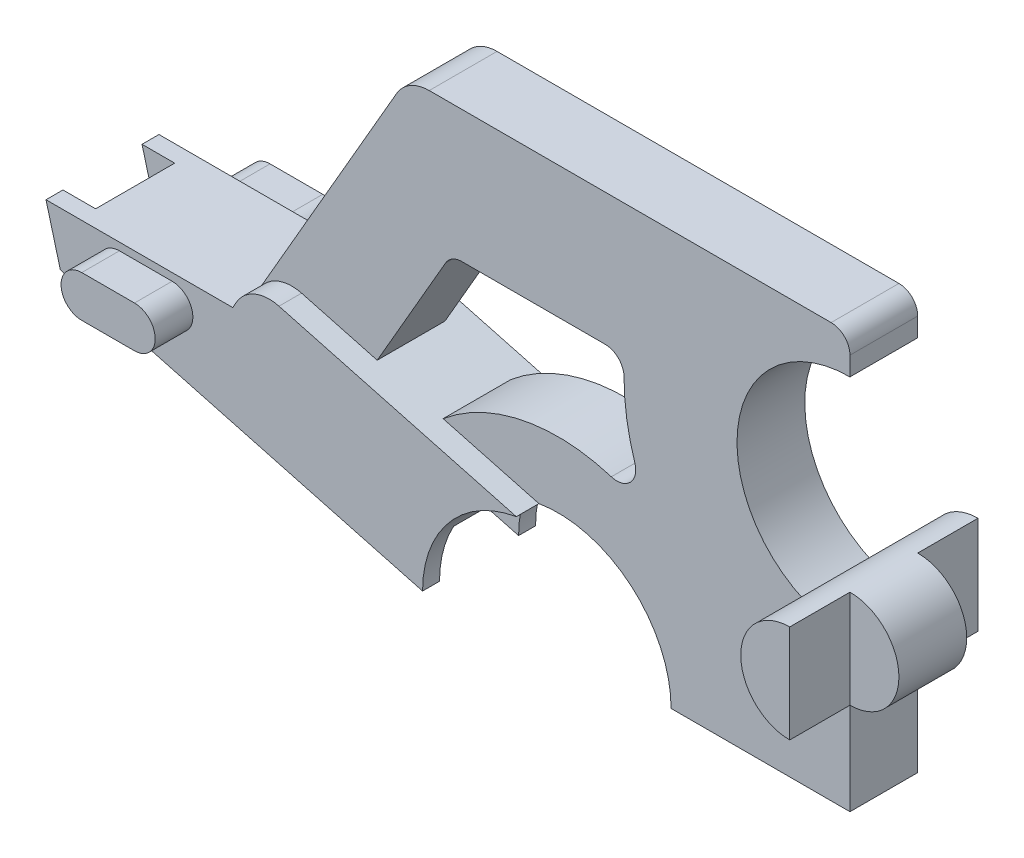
ISO-10303-21;
HEADER;
FILE_DESCRIPTION(('STEP AP214'),'2;1');
FILE_NAME('part.step','',(''),(''),'','','');
FILE_SCHEMA(('AUTOMOTIVE_DESIGN { 1 0 10303 214 1 1 1 1 }'));
ENDSEC;
DATA;
#1=APPLICATION_CONTEXT('core data for automotive mechanical design processes');
#2=APPLICATION_PROTOCOL_DEFINITION('international standard','automotive_design',2000,#1);
#3=PRODUCT_CONTEXT('',#1,'mechanical');
#4=PRODUCT('Part','Part','',(#3));
#5=PRODUCT_RELATED_PRODUCT_CATEGORY('part','',(#4));
#6=PRODUCT_DEFINITION_FORMATION('','',#4);
#7=PRODUCT_DEFINITION_CONTEXT('part definition',#1,'design');
#8=PRODUCT_DEFINITION('design','',#6,#7);
#9=PRODUCT_DEFINITION_SHAPE('','',#8);
#10=(LENGTH_UNIT() NAMED_UNIT(*) SI_UNIT(.MILLI.,.METRE.));
#11=(NAMED_UNIT(*) PLANE_ANGLE_UNIT() SI_UNIT($,.RADIAN.));
#12=(NAMED_UNIT(*) SI_UNIT($,.STERADIAN.) SOLID_ANGLE_UNIT());
#13=UNCERTAINTY_MEASURE_WITH_UNIT(LENGTH_MEASURE(1.E-05),#10,'distance_accuracy_value','');
#14=(GEOMETRIC_REPRESENTATION_CONTEXT(3) GLOBAL_UNCERTAINTY_ASSIGNED_CONTEXT((#13)) GLOBAL_UNIT_ASSIGNED_CONTEXT((#10,
#11,#12)) REPRESENTATION_CONTEXT('',''));
#15=CARTESIAN_POINT('',(0.,0.,0.));
#16=DIRECTION('',(0.,0.,1.));
#17=DIRECTION('',(1.,0.,0.));
#18=AXIS2_PLACEMENT_3D('',#15,#16,#17);
#19=CARTESIAN_POINT('',(-26.,8.,1.8));
#20=DIRECTION('',(0.965925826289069,0.258819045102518,0.));
#21=DIRECTION('',(-0.258819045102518,0.965925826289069,0.));
#22=AXIS2_PLACEMENT_3D('',#19,#20,#21);
#23=PLANE('',#22);
#24=DIRECTION('',(-0.258819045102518,0.965925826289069,0.));
#25=VECTOR('',#24,1.);
#26=CARTESIAN_POINT('',(-26.,8.,2.1));
#27=LINE('',#26,#25);
#28=CARTESIAN_POINT('',(-25.237604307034,5.15470053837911,2.1));
#29=VERTEX_POINT('',#28);
#30=CARTESIAN_POINT('',(-26.,8.,2.1));
#31=VERTEX_POINT('',#30);
#32=EDGE_CURVE('E295',#29,#31,#27,.T.);
#33=ORIENTED_EDGE('',*,*,#32,.F.);
#34=DIRECTION('',(0.,0.,-1.));
#35=VECTOR('',#34,1.);
#36=CARTESIAN_POINT('',(-25.237604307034,5.15470053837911,1.8));
#37=LINE('',#36,#35);
#38=CARTESIAN_POINT('',(-25.237604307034,5.15470053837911,3.));
#39=VERTEX_POINT('',#38);
#40=EDGE_CURVE('E545',#39,#29,#37,.T.);
#41=ORIENTED_EDGE('',*,*,#40,.F.);
#42=DIRECTION('',(0.258819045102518,-0.965925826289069,0.));
#43=VECTOR('',#42,1.);
#44=CARTESIAN_POINT('',(-26.,8.,3.));
#45=LINE('',#44,#43);
#46=CARTESIAN_POINT('',(-26.,8.,3.));
#47=VERTEX_POINT('',#46);
#48=EDGE_CURVE('E438',#47,#39,#45,.T.);
#49=ORIENTED_EDGE('',*,*,#48,.F.);
#50=DIRECTION('',(0.,0.,-1.));
#51=VECTOR('',#50,1.);
#52=CARTESIAN_POINT('',(-26.,8.,1.8));
#53=LINE('',#52,#51);
#54=EDGE_CURVE('E549',#47,#31,#53,.T.);
#55=ORIENTED_EDGE('',*,*,#54,.T.);
#56=EDGE_LOOP('',(#33,#41,#49,#55));
#57=FACE_BOUND('',#56,.T.);
#58=ADVANCED_FACE('F17',(#57),#23,.F.);
#59=CARTESIAN_POINT('',(-6.,0.,1.8));
#60=DIRECTION('',(0.258819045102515,0.96592582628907,0.));
#61=DIRECTION('',(-0.96592582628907,0.258819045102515,0.));
#62=AXIS2_PLACEMENT_3D('',#59,#60,#61);
#63=PLANE('',#62);
#64=DIRECTION('',(-0.96592582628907,0.258819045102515,0.));
#65=VECTOR('',#64,1.);
#66=CARTESIAN_POINT('',(-6.,0.,2.1));
#67=LINE('',#66,#65);
#68=CARTESIAN_POINT('',(-6.,0.,2.1));
#69=VERTEX_POINT('',#68);
#70=EDGE_CURVE('E620',#69,#29,#67,.T.);
#71=ORIENTED_EDGE('',*,*,#70,.F.);
#72=DIRECTION('',(0.,0.,-1.));
#73=VECTOR('',#72,1.);
#74=CARTESIAN_POINT('',(-6.,0.,1.8));
#75=LINE('',#74,#73);
#76=CARTESIAN_POINT('',(-6.,0.,3.));
#77=VERTEX_POINT('',#76);
#78=EDGE_CURVE('E541',#77,#69,#75,.T.);
#79=ORIENTED_EDGE('',*,*,#78,.F.);
#80=DIRECTION('',(0.96592582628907,-0.258819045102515,0.));
#81=VECTOR('',#80,1.);
#82=CARTESIAN_POINT('',(-25.237604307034,5.15470053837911,3.));
#83=LINE('',#82,#81);
#84=EDGE_CURVE('E441',#39,#77,#83,.T.);
#85=ORIENTED_EDGE('',*,*,#84,.F.);
#86=ORIENTED_EDGE('',*,*,#40,.T.);
#87=EDGE_LOOP('',(#71,#79,#85,#86));
#88=FACE_BOUND('',#87,.T.);
#89=ADVANCED_FACE('F622',(#88),#63,.F.);
#90=CARTESIAN_POINT('',(-14.143860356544,7.35852170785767,-3.));
#91=DIRECTION('',(0.,0.,-1.));
#92=DIRECTION('',(-1.,0.,0.));
#93=AXIS2_PLACEMENT_3D('',#90,#91,#92);
#94=PLANE('',#93);
#95=CARTESIAN_POINT('',(-14.143860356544,7.35852170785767,-3.));
#96=DIRECTION('',(0.,0.,1.));
#97=DIRECTION('',(-1.,0.,0.));
#98=AXIS2_PLACEMENT_3D('',#95,#96,#97);
#99=CIRCLE('',#98,2.);
#100=CARTESIAN_POINT('',(-13.626222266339,9.29037336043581,-3.));
#101=VERTEX_POINT('',#100);
#102=CARTESIAN_POINT('',(-15.8759111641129,8.35852170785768,-3.));
#103=VERTEX_POINT('',#102);
#104=EDGE_CURVE('E408',#101,#103,#99,.T.);
#105=ORIENTED_EDGE('',*,*,#104,.F.);
#106=DIRECTION('',(-0.96592582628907,0.258819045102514,0.));
#107=VECTOR('',#106,1.);
#108=CARTESIAN_POINT('',(-13.626222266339,9.29037336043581,-3.));
#109=LINE('',#108,#107);
#110=CARTESIAN_POINT('',(-1.02026809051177,5.91261811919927,-3.));
#111=VERTEX_POINT('',#110);
#112=EDGE_CURVE('E426',#111,#101,#109,.T.);
#113=ORIENTED_EDGE('',*,*,#112,.F.);
#114=CARTESIAN_POINT('',(0.,0.,-3.));
#115=DIRECTION('',(0.,0.,-1.));
#116=DIRECTION('',(1.,0.,0.));
#117=AXIS2_PLACEMENT_3D('',#114,#115,#116);
#118=CIRCLE('',#117,6.);
#119=CARTESIAN_POINT('',(-6.,0.,-3.));
#120=VERTEX_POINT('',#119);
#121=EDGE_CURVE('E423',#120,#111,#118,.T.);
#122=ORIENTED_EDGE('',*,*,#121,.F.);
#123=DIRECTION('',(0.96592582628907,-0.258819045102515,0.));
#124=VECTOR('',#123,1.);
#125=CARTESIAN_POINT('',(-25.237604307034,5.15470053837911,-3.));
#126=LINE('',#125,#124);
#127=CARTESIAN_POINT('',(-25.237604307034,5.15470053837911,-3.));
#128=VERTEX_POINT('',#127);
#129=EDGE_CURVE('E420',#128,#120,#126,.T.);
#130=ORIENTED_EDGE('',*,*,#129,.F.);
#131=DIRECTION('',(0.258819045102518,-0.965925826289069,0.));
#132=VECTOR('',#131,1.);
#133=CARTESIAN_POINT('',(-26.,8.,-3.));
#134=LINE('',#133,#132);
#135=CARTESIAN_POINT('',(-26.,8.,-3.));
#136=VERTEX_POINT('',#135);
#137=EDGE_CURVE('E417',#136,#128,#134,.T.);
#138=ORIENTED_EDGE('',*,*,#137,.F.);
#139=DIRECTION('',(-1.,0.,0.));
#140=VECTOR('',#139,1.);
#141=CARTESIAN_POINT('',(-16.0829037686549,8.,-3.));
#142=LINE('',#141,#140);
#143=CARTESIAN_POINT('',(-16.0829037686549,8.,-3.));
#144=VERTEX_POINT('',#143);
#145=EDGE_CURVE('E414',#144,#136,#142,.T.);
#146=ORIENTED_EDGE('',*,*,#145,.F.);
#147=DIRECTION('',(-0.5,-0.866025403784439,0.));
#148=VECTOR('',#147,1.);
#149=CARTESIAN_POINT('',(-15.8759111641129,8.35852170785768,-3.));
#150=LINE('',#149,#148);
#151=EDGE_CURVE('E411',#103,#144,#150,.T.);
#152=ORIENTED_EDGE('',*,*,#151,.F.);
#153=EDGE_LOOP('',(#105,#113,#122,#130,#138,#146,#152));
#154=FACE_BOUND('',#153,.T.);
#155=DIRECTION('',(-1.,0.,0.));
#156=VECTOR('',#155,1.);
#157=CARTESIAN_POINT('',(-14.143860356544,7.6,-3.));
#158=LINE('',#157,#156);
#159=CARTESIAN_POINT('',(-19.3,7.6,-3.));
#160=VERTEX_POINT('',#159);
#161=CARTESIAN_POINT('',(-22.1,7.6,-3.));
#162=VERTEX_POINT('',#161);
#163=EDGE_CURVE('E356',#160,#162,#158,.T.);
#164=ORIENTED_EDGE('',*,*,#163,.T.);
#165=CARTESIAN_POINT('',(-22.1,6.5,-3.));
#166=DIRECTION('',(0.,0.,-1.));
#167=DIRECTION('',(-1.,0.,0.));
#168=AXIS2_PLACEMENT_3D('',#165,#166,#167);
#169=CIRCLE('',#168,1.1);
#170=CARTESIAN_POINT('',(-22.1,5.4,-3.));
#171=VERTEX_POINT('',#170);
#172=EDGE_CURVE('E365',#162,#171,#169,.F.);
#173=ORIENTED_EDGE('',*,*,#172,.T.);
#174=DIRECTION('',(1.,0.,0.));
#175=VECTOR('',#174,1.);
#176=CARTESIAN_POINT('',(-14.143860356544,5.4,-3.));
#177=LINE('',#176,#175);
#178=CARTESIAN_POINT('',(-19.3,5.4,-3.));
#179=VERTEX_POINT('',#178);
#180=EDGE_CURVE('E362',#171,#179,#177,.T.);
#181=ORIENTED_EDGE('',*,*,#180,.T.);
#182=CARTESIAN_POINT('',(-19.3,6.5,-3.));
#183=DIRECTION('',(0.,0.,-1.));
#184=DIRECTION('',(-1.,0.,0.));
#185=AXIS2_PLACEMENT_3D('',#182,#183,#184);
#186=CIRCLE('',#185,1.1);
#187=EDGE_CURVE('E359',#179,#160,#186,.F.);
#188=ORIENTED_EDGE('',*,*,#187,.T.);
#189=EDGE_LOOP('',(#164,#173,#181,#188));
#190=FACE_BOUND('',#189,.T.);
#191=ADVANCED_FACE('F641',(#154,#190),#94,.T.);
#192=CARTESIAN_POINT('',(-14.143860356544,7.35852170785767,3.));
#193=DIRECTION('',(0.,0.,-1.));
#194=DIRECTION('',(-1.,0.,0.));
#195=AXIS2_PLACEMENT_3D('',#192,#193,#194);
#196=PLANE('',#195);
#197=CARTESIAN_POINT('',(-14.143860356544,7.35852170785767,3.));
#198=DIRECTION('',(0.,0.,1.));
#199=DIRECTION('',(-1.,0.,0.));
#200=AXIS2_PLACEMENT_3D('',#197,#198,#199);
#201=CIRCLE('',#200,2.);
#202=CARTESIAN_POINT('',(-13.626222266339,9.29037336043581,3.));
#203=VERTEX_POINT('',#202);
#204=CARTESIAN_POINT('',(-15.8759111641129,8.35852170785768,3.));
#205=VERTEX_POINT('',#204);
#206=EDGE_CURVE('E429',#203,#205,#201,.T.);
#207=ORIENTED_EDGE('',*,*,#206,.T.);
#208=DIRECTION('',(-0.5,-0.866025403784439,0.));
#209=VECTOR('',#208,1.);
#210=CARTESIAN_POINT('',(-15.8759111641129,8.35852170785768,3.));
#211=LINE('',#210,#209);
#212=CARTESIAN_POINT('',(-16.0829037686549,8.,3.));
#213=VERTEX_POINT('',#212);
#214=EDGE_CURVE('E432',#205,#213,#211,.T.);
#215=ORIENTED_EDGE('',*,*,#214,.T.);
#216=DIRECTION('',(-1.,0.,0.));
#217=VECTOR('',#216,1.);
#218=CARTESIAN_POINT('',(-16.0829037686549,8.,3.));
#219=LINE('',#218,#217);
#220=EDGE_CURVE('E435',#213,#47,#219,.T.);
#221=ORIENTED_EDGE('',*,*,#220,.T.);
#222=ORIENTED_EDGE('',*,*,#48,.T.);
#223=ORIENTED_EDGE('',*,*,#84,.T.);
#224=CARTESIAN_POINT('',(0.,0.,3.));
#225=DIRECTION('',(0.,0.,-1.));
#226=DIRECTION('',(1.,0.,0.));
#227=AXIS2_PLACEMENT_3D('',#224,#225,#226);
#228=CIRCLE('',#227,6.);
#229=CARTESIAN_POINT('',(-1.02026809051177,5.91261811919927,3.));
#230=VERTEX_POINT('',#229);
#231=EDGE_CURVE('E444',#77,#230,#228,.T.);
#232=ORIENTED_EDGE('',*,*,#231,.T.);
#233=DIRECTION('',(-0.96592582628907,0.258819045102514,0.));
#234=VECTOR('',#233,1.);
#235=CARTESIAN_POINT('',(-13.626222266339,9.29037336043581,3.));
#236=LINE('',#235,#234);
#237=EDGE_CURVE('E446',#230,#203,#236,.T.);
#238=ORIENTED_EDGE('',*,*,#237,.T.);
#239=EDGE_LOOP('',(#207,#215,#221,#222,#223,#232,#238));
#240=FACE_BOUND('',#239,.T.);
#241=CARTESIAN_POINT('',(-22.1,6.5,3.));
#242=DIRECTION('',(0.,0.,-1.));
#243=DIRECTION('',(-1.,0.,0.));
#244=AXIS2_PLACEMENT_3D('',#241,#242,#243);
#245=CIRCLE('',#244,1.1);
#246=CARTESIAN_POINT('',(-22.1,7.6,3.));
#247=VERTEX_POINT('',#246);
#248=CARTESIAN_POINT('',(-22.1,5.4,3.));
#249=VERTEX_POINT('',#248);
#250=EDGE_CURVE('E565',#247,#249,#245,.F.);
#251=ORIENTED_EDGE('',*,*,#250,.F.);
#252=DIRECTION('',(-1.,0.,0.));
#253=VECTOR('',#252,1.);
#254=CARTESIAN_POINT('',(-14.143860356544,7.6,3.));
#255=LINE('',#254,#253);
#256=CARTESIAN_POINT('',(-19.3,7.6,3.));
#257=VERTEX_POINT('',#256);
#258=EDGE_CURVE('E556',#257,#247,#255,.T.);
#259=ORIENTED_EDGE('',*,*,#258,.F.);
#260=CARTESIAN_POINT('',(-19.3,6.5,3.));
#261=DIRECTION('',(0.,0.,-1.));
#262=DIRECTION('',(-1.,0.,0.));
#263=AXIS2_PLACEMENT_3D('',#260,#261,#262);
#264=CIRCLE('',#263,1.1);
#265=CARTESIAN_POINT('',(-19.3,5.4,3.));
#266=VERTEX_POINT('',#265);
#267=EDGE_CURVE('E559',#266,#257,#264,.F.);
#268=ORIENTED_EDGE('',*,*,#267,.F.);
#269=DIRECTION('',(1.,0.,0.));
#270=VECTOR('',#269,1.);
#271=CARTESIAN_POINT('',(-14.143860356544,5.4,3.));
#272=LINE('',#271,#270);
#273=EDGE_CURVE('E562',#249,#266,#272,.T.);
#274=ORIENTED_EDGE('',*,*,#273,.F.);
#275=EDGE_LOOP('',(#251,#259,#268,#274));
#276=FACE_BOUND('',#275,.T.);
#277=ADVANCED_FACE('F746',(#240,#276),#196,.F.);
#278=CARTESIAN_POINT('',(0.,0.,1.8));
#279=DIRECTION('',(0.,0.,1.));
#280=DIRECTION('',(1.,0.,0.));
#281=AXIS2_PLACEMENT_3D('',#278,#279,#280);
#282=PLANE('',#281);
#283=DIRECTION('',(0.,1.,0.));
#284=VECTOR('',#283,1.);
#285=CARTESIAN_POINT('',(15.5,20.,1.8));
#286=LINE('',#285,#284);
#287=CARTESIAN_POINT('',(15.5,20.,1.8));
#288=VERTEX_POINT('',#287);
#289=CARTESIAN_POINT('',(15.5,21.,1.8));
#290=VERTEX_POINT('',#289);
#291=EDGE_CURVE('E527',#288,#290,#286,.T.);
#292=ORIENTED_EDGE('',*,*,#291,.T.);
#293=CARTESIAN_POINT('',(14.5,21.,1.8));
#294=DIRECTION('',(0.,0.,1.));
#295=DIRECTION('',(1.,0.,0.));
#296=AXIS2_PLACEMENT_3D('',#293,#294,#295);
#297=CIRCLE('',#296,1.);
#298=CARTESIAN_POINT('',(14.5,22.,1.8));
#299=VERTEX_POINT('',#298);
#300=EDGE_CURVE('E600',#290,#299,#297,.T.);
#301=ORIENTED_EDGE('',*,*,#300,.T.);
#302=DIRECTION('',(-1.,0.,0.));
#303=VECTOR('',#302,1.);
#304=CARTESIAN_POINT('',(-8.,22.,1.8));
#305=LINE('',#304,#303);
#306=CARTESIAN_POINT('',(-6.84529946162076,22.,1.8));
#307=VERTEX_POINT('',#306);
#308=EDGE_CURVE('E529',#299,#307,#305,.T.);
#309=ORIENTED_EDGE('',*,*,#308,.T.);
#310=CARTESIAN_POINT('',(-6.84529946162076,20.,1.8));
#311=DIRECTION('',(0.,0.,1.));
#312=DIRECTION('',(1.,0.,0.));
#313=AXIS2_PLACEMENT_3D('',#310,#311,#312);
#314=CIRCLE('',#313,2.);
#315=CARTESIAN_POINT('',(-8.57735026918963,21.,1.8));
#316=VERTEX_POINT('',#315);
#317=EDGE_CURVE('E577',#307,#316,#314,.T.);
#318=ORIENTED_EDGE('',*,*,#317,.T.);
#319=DIRECTION('',(-0.5,-0.866025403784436,0.));
#320=VECTOR('',#319,1.);
#321=CARTESIAN_POINT('',(-8.,22.,1.8));
#322=LINE('',#321,#320);
#323=CARTESIAN_POINT('',(-15.8759111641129,8.35852170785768,1.8));
#324=VERTEX_POINT('',#323);
#325=EDGE_CURVE('E516',#316,#324,#322,.T.);
#326=ORIENTED_EDGE('',*,*,#325,.T.);
#327=CARTESIAN_POINT('',(-14.143860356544,7.35852170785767,1.8));
#328=DIRECTION('',(0.,0.,1.));
#329=DIRECTION('',(1.,0.,0.));
#330=AXIS2_PLACEMENT_3D('',#327,#328,#329);
#331=CIRCLE('',#330,2.);
#332=CARTESIAN_POINT('',(-13.626222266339,9.29037336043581,1.8));
#333=VERTEX_POINT('',#332);
#334=EDGE_CURVE('E470',#324,#333,#331,.F.);
#335=ORIENTED_EDGE('',*,*,#334,.T.);
#336=DIRECTION('',(0.96592582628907,-0.258819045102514,0.));
#337=VECTOR('',#336,1.);
#338=CARTESIAN_POINT('',(1.40980952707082,5.26148078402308,1.8));
#339=LINE('',#338,#337);
#340=CARTESIAN_POINT('',(-9.6085841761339,8.21385047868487,1.8));
#341=VERTEX_POINT('',#340);
#342=EDGE_CURVE('E466',#333,#341,#339,.T.);
#343=ORIENTED_EDGE('',*,*,#342,.T.);
#344=DIRECTION('',(-0.5,-0.866025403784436,0.));
#345=VECTOR('',#344,1.);
#346=CARTESIAN_POINT('',(-9.6085841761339,8.21385047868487,1.8));
#347=LINE('',#346,#345);
#348=CARTESIAN_POINT('',(-5.97927405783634,14.5,1.8));
#349=VERTEX_POINT('',#348);
#350=EDGE_CURVE('E490',#349,#341,#347,.T.);
#351=ORIENTED_EDGE('',*,*,#350,.F.);
#352=CARTESIAN_POINT('',(-5.1132486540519,14.,1.8));
#353=DIRECTION('',(0.,0.,1.));
#354=DIRECTION('',(1.,0.,0.));
#355=AXIS2_PLACEMENT_3D('',#352,#353,#354);
#356=CIRCLE('',#355,1.);
#357=CARTESIAN_POINT('',(-5.1132486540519,15.,1.8));
#358=VERTEX_POINT('',#357);
#359=EDGE_CURVE('E604',#349,#358,#356,.F.);
#360=ORIENTED_EDGE('',*,*,#359,.T.);
#361=DIRECTION('',(-1.,0.,0.));
#362=VECTOR('',#361,1.);
#363=CARTESIAN_POINT('',(-5.69059892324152,15.,1.8));
#364=LINE('',#363,#362);
#365=CARTESIAN_POINT('',(2.5,15.,1.8));
#366=VERTEX_POINT('',#365);
#367=EDGE_CURVE('E487',#366,#358,#364,.T.);
#368=ORIENTED_EDGE('',*,*,#367,.F.);
#369=CARTESIAN_POINT('',(2.5,14.,1.8));
#370=DIRECTION('',(0.,0.,1.));
#371=DIRECTION('',(1.,0.,0.));
#372=AXIS2_PLACEMENT_3D('',#369,#370,#371);
#373=CIRCLE('',#372,1.);
#374=CARTESIAN_POINT('',(3.5,14.,1.8));
#375=VERTEX_POINT('',#374);
#376=EDGE_CURVE('E608',#366,#375,#373,.F.);
#377=ORIENTED_EDGE('',*,*,#376,.T.);
#378=CARTESIAN_POINT('',(15.5,14.,1.8));
#379=DIRECTION('',(0.,0.,-1.));
#380=DIRECTION('',(1.,0.,0.));
#381=AXIS2_PLACEMENT_3D('',#378,#379,#380);
#382=CIRCLE('',#381,12.);
#383=CARTESIAN_POINT('',(4.07475549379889,10.3306965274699,1.8));
#384=VERTEX_POINT('',#383);
#385=EDGE_CURVE('E484',#384,#375,#382,.T.);
#386=ORIENTED_EDGE('',*,*,#385,.F.);
#387=CARTESIAN_POINT('',(3.1226517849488,10.0249212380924,1.8));
#388=DIRECTION('',(0.,0.,1.));
#389=DIRECTION('',(1.,0.,0.));
#390=AXIS2_PLACEMENT_3D('',#387,#388,#389);
#391=CIRCLE('',#390,1.);
#392=CARTESIAN_POINT('',(2.82525637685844,9.07016683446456,1.8));
#393=VERTEX_POINT('',#392);
#394=EDGE_CURVE('E612',#384,#393,#391,.F.);
#395=ORIENTED_EDGE('',*,*,#394,.T.);
#396=CARTESIAN_POINT('',(0.,0.,1.8));
#397=DIRECTION('',(0.,0.,-1.));
#398=DIRECTION('',(1.,0.,0.));
#399=AXIS2_PLACEMENT_3D('',#396,#397,#398);
#400=CIRCLE('',#399,9.5);
#401=CARTESIAN_POINT('',(-6.10824981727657,7.27593871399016,1.8));
#402=VERTEX_POINT('',#401);
#403=EDGE_CURVE('E492',#402,#393,#400,.T.);
#404=ORIENTED_EDGE('',*,*,#403,.F.);
#405=CARTESIAN_POINT('',(-1.02026809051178,5.91261811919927,1.8));
#406=VERTEX_POINT('',#405);
#407=EDGE_CURVE('E462',#402,#406,#339,.T.);
#408=ORIENTED_EDGE('',*,*,#407,.T.);
#409=CARTESIAN_POINT('',(0.,0.,1.8));
#410=DIRECTION('',(0.,0.,-1.));
#411=DIRECTION('',(1.,0.,0.));
#412=AXIS2_PLACEMENT_3D('',#409,#410,#411);
#413=CIRCLE('',#412,6.);
#414=CARTESIAN_POINT('',(6.,0.,1.8));
#415=VERTEX_POINT('',#414);
#416=EDGE_CURVE('E518',#406,#415,#413,.T.);
#417=ORIENTED_EDGE('',*,*,#416,.T.);
#418=DIRECTION('',(1.,0.,0.));
#419=VECTOR('',#418,1.);
#420=CARTESIAN_POINT('',(6.,0.,1.8));
#421=LINE('',#420,#419);
#422=CARTESIAN_POINT('',(15.5,0.,1.8));
#423=VERTEX_POINT('',#422);
#424=EDGE_CURVE('E520',#415,#423,#421,.T.);
#425=ORIENTED_EDGE('',*,*,#424,.T.);
#426=DIRECTION('',(0.,1.,0.));
#427=VECTOR('',#426,1.);
#428=CARTESIAN_POINT('',(15.5,0.,1.8));
#429=LINE('',#428,#427);
#430=CARTESIAN_POINT('',(15.5,4.9,1.8));
#431=VERTEX_POINT('',#430);
#432=EDGE_CURVE('E522',#423,#431,#429,.T.);
#433=ORIENTED_EDGE('',*,*,#432,.T.);
#434=CARTESIAN_POINT('',(15.5,7.5,1.8));
#435=DIRECTION('',(0.,0.,1.));
#436=DIRECTION('',(1.,0.,0.));
#437=AXIS2_PLACEMENT_3D('',#434,#435,#436);
#438=CIRCLE('',#437,2.6);
#439=CARTESIAN_POINT('',(13.1003206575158,8.50076923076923,1.8));
#440=VERTEX_POINT('',#439);
#441=EDGE_CURVE('E402',#431,#440,#438,.F.);
#442=ORIENTED_EDGE('',*,*,#441,.T.);
#443=CARTESIAN_POINT('',(15.5,14.,1.8));
#444=DIRECTION('',(0.,0.,-1.));
#445=DIRECTION('',(-1.,0.,0.));
#446=AXIS2_PLACEMENT_3D('',#443,#444,#445);
#447=CIRCLE('',#446,6.);
#448=EDGE_CURVE('E525',#440,#288,#447,.T.);
#449=ORIENTED_EDGE('',*,*,#448,.T.);
#450=EDGE_LOOP('',(#292,#301,#309,#318,#326,#335,#343,#351,#360,#368,#377,#386,#395,#404,#408,
#417,#425,#433,#442,#449));
#451=FACE_BOUND('',#450,.T.);
#452=ADVANCED_FACE('F749',(#451),#282,.T.);
#453=CARTESIAN_POINT('',(0.,0.,-1.8));
#454=DIRECTION('',(0.,0.,1.));
#455=DIRECTION('',(1.,0.,0.));
#456=AXIS2_PLACEMENT_3D('',#453,#454,#455);
#457=PLANE('',#456);
#458=DIRECTION('',(-1.,0.,0.));
#459=VECTOR('',#458,1.);
#460=CARTESIAN_POINT('',(-8.,22.,-1.8));
#461=LINE('',#460,#459);
#462=CARTESIAN_POINT('',(14.5,22.,-1.8));
#463=VERTEX_POINT('',#462);
#464=CARTESIAN_POINT('',(-6.84529946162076,22.,-1.8));
#465=VERTEX_POINT('',#464);
#466=EDGE_CURVE('E514',#463,#465,#461,.T.);
#467=ORIENTED_EDGE('',*,*,#466,.F.);
#468=CARTESIAN_POINT('',(14.5,21.,-1.8));
#469=DIRECTION('',(0.,0.,1.));
#470=DIRECTION('',(1.,0.,0.));
#471=AXIS2_PLACEMENT_3D('',#468,#469,#470);
#472=CIRCLE('',#471,1.);
#473=CARTESIAN_POINT('',(15.5,21.,-1.8));
#474=VERTEX_POINT('',#473);
#475=EDGE_CURVE('E597',#463,#474,#472,.F.);
#476=ORIENTED_EDGE('',*,*,#475,.T.);
#477=DIRECTION('',(0.,1.,0.));
#478=VECTOR('',#477,1.);
#479=CARTESIAN_POINT('',(15.5,20.,-1.8));
#480=LINE('',#479,#478);
#481=CARTESIAN_POINT('',(15.5,20.,-1.8));
#482=VERTEX_POINT('',#481);
#483=EDGE_CURVE('E512',#482,#474,#480,.T.);
#484=ORIENTED_EDGE('',*,*,#483,.F.);
#485=CARTESIAN_POINT('',(15.5,14.,-1.8));
#486=DIRECTION('',(0.,0.,-1.));
#487=DIRECTION('',(-1.,0.,0.));
#488=AXIS2_PLACEMENT_3D('',#485,#486,#487);
#489=CIRCLE('',#488,6.);
#490=CARTESIAN_POINT('',(13.1003206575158,8.50076923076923,-1.8));
#491=VERTEX_POINT('',#490);
#492=EDGE_CURVE('E510',#491,#482,#489,.T.);
#493=ORIENTED_EDGE('',*,*,#492,.F.);
#494=CARTESIAN_POINT('',(15.5,7.5,-1.8));
#495=DIRECTION('',(0.,0.,1.));
#496=DIRECTION('',(1.,0.,0.));
#497=AXIS2_PLACEMENT_3D('',#494,#495,#496);
#498=CIRCLE('',#497,2.6);
#499=CARTESIAN_POINT('',(15.5,4.9,-1.8));
#500=VERTEX_POINT('',#499);
#501=EDGE_CURVE('E399',#500,#491,#498,.F.);
#502=ORIENTED_EDGE('',*,*,#501,.F.);
#503=DIRECTION('',(0.,1.,0.));
#504=VECTOR('',#503,1.);
#505=CARTESIAN_POINT('',(15.5,0.,-1.8));
#506=LINE('',#505,#504);
#507=CARTESIAN_POINT('',(15.5,0.,-1.8));
#508=VERTEX_POINT('',#507);
#509=EDGE_CURVE('E507',#508,#500,#506,.T.);
#510=ORIENTED_EDGE('',*,*,#509,.F.);
#511=DIRECTION('',(1.,0.,0.));
#512=VECTOR('',#511,1.);
#513=CARTESIAN_POINT('',(6.,0.,-1.8));
#514=LINE('',#513,#512);
#515=CARTESIAN_POINT('',(6.,0.,-1.8));
#516=VERTEX_POINT('',#515);
#517=EDGE_CURVE('E505',#516,#508,#514,.T.);
#518=ORIENTED_EDGE('',*,*,#517,.F.);
#519=CARTESIAN_POINT('',(0.,0.,-1.8));
#520=DIRECTION('',(0.,0.,-1.));
#521=DIRECTION('',(1.,0.,0.));
#522=AXIS2_PLACEMENT_3D('',#519,#520,#521);
#523=CIRCLE('',#522,6.);
#524=CARTESIAN_POINT('',(-1.02026809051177,5.91261811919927,-1.8));
#525=VERTEX_POINT('',#524);
#526=EDGE_CURVE('E503',#525,#516,#523,.T.);
#527=ORIENTED_EDGE('',*,*,#526,.F.);
#528=DIRECTION('',(0.96592582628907,-0.258819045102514,0.));
#529=VECTOR('',#528,1.);
#530=CARTESIAN_POINT('',(1.40980952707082,5.26148078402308,-1.8));
#531=LINE('',#530,#529);
#532=CARTESIAN_POINT('',(-6.10824981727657,7.27593871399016,-1.8));
#533=VERTEX_POINT('',#532);
#534=EDGE_CURVE('E459',#533,#525,#531,.T.);
#535=ORIENTED_EDGE('',*,*,#534,.F.);
#536=CARTESIAN_POINT('',(0.,0.,-1.8));
#537=DIRECTION('',(0.,0.,-1.));
#538=DIRECTION('',(1.,0.,0.));
#539=AXIS2_PLACEMENT_3D('',#536,#537,#538);
#540=CIRCLE('',#539,9.5);
#541=CARTESIAN_POINT('',(2.82525637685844,9.07016683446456,-1.8));
#542=VERTEX_POINT('',#541);
#543=EDGE_CURVE('E481',#533,#542,#540,.T.);
#544=ORIENTED_EDGE('',*,*,#543,.T.);
#545=CARTESIAN_POINT('',(3.1226517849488,10.0249212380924,-1.8));
#546=DIRECTION('',(0.,0.,1.));
#547=DIRECTION('',(1.,0.,0.));
#548=AXIS2_PLACEMENT_3D('',#545,#546,#547);
#549=CIRCLE('',#548,1.);
#550=CARTESIAN_POINT('',(4.07475549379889,10.3306965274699,-1.8));
#551=VERTEX_POINT('',#550);
#552=EDGE_CURVE('E610',#542,#551,#549,.T.);
#553=ORIENTED_EDGE('',*,*,#552,.T.);
#554=CARTESIAN_POINT('',(15.5,14.,-1.8));
#555=DIRECTION('',(0.,0.,-1.));
#556=DIRECTION('',(1.,0.,0.));
#557=AXIS2_PLACEMENT_3D('',#554,#555,#556);
#558=CIRCLE('',#557,12.);
#559=CARTESIAN_POINT('',(3.5,14.,-1.8));
#560=VERTEX_POINT('',#559);
#561=EDGE_CURVE('E473',#551,#560,#558,.T.);
#562=ORIENTED_EDGE('',*,*,#561,.T.);
#563=CARTESIAN_POINT('',(2.5,14.,-1.8));
#564=DIRECTION('',(0.,0.,1.));
#565=DIRECTION('',(1.,0.,0.));
#566=AXIS2_PLACEMENT_3D('',#563,#564,#565);
#567=CIRCLE('',#566,1.);
#568=CARTESIAN_POINT('',(2.5,15.,-1.8));
#569=VERTEX_POINT('',#568);
#570=EDGE_CURVE('E606',#560,#569,#567,.T.);
#571=ORIENTED_EDGE('',*,*,#570,.T.);
#572=DIRECTION('',(-1.,0.,0.));
#573=VECTOR('',#572,1.);
#574=CARTESIAN_POINT('',(-5.69059892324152,15.,-1.8));
#575=LINE('',#574,#573);
#576=CARTESIAN_POINT('',(-5.1132486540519,15.,-1.8));
#577=VERTEX_POINT('',#576);
#578=EDGE_CURVE('E476',#569,#577,#575,.T.);
#579=ORIENTED_EDGE('',*,*,#578,.T.);
#580=CARTESIAN_POINT('',(-5.1132486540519,14.,-1.8));
#581=DIRECTION('',(0.,0.,1.));
#582=DIRECTION('',(1.,0.,0.));
#583=AXIS2_PLACEMENT_3D('',#580,#581,#582);
#584=CIRCLE('',#583,1.);
#585=CARTESIAN_POINT('',(-5.97927405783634,14.5,-1.8));
#586=VERTEX_POINT('',#585);
#587=EDGE_CURVE('E602',#577,#586,#584,.T.);
#588=ORIENTED_EDGE('',*,*,#587,.T.);
#589=DIRECTION('',(-0.5,-0.866025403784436,0.));
#590=VECTOR('',#589,1.);
#591=CARTESIAN_POINT('',(-9.6085841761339,8.21385047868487,-1.8));
#592=LINE('',#591,#590);
#593=CARTESIAN_POINT('',(-9.6085841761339,8.21385047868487,-1.8));
#594=VERTEX_POINT('',#593);
#595=EDGE_CURVE('E479',#586,#594,#592,.T.);
#596=ORIENTED_EDGE('',*,*,#595,.T.);
#597=CARTESIAN_POINT('',(-13.626222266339,9.29037336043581,-1.8));
#598=VERTEX_POINT('',#597);
#599=EDGE_CURVE('E463',#598,#594,#531,.T.);
#600=ORIENTED_EDGE('',*,*,#599,.F.);
#601=CARTESIAN_POINT('',(-14.143860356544,7.35852170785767,-1.8));
#602=DIRECTION('',(0.,0.,1.));
#603=DIRECTION('',(1.,0.,0.));
#604=AXIS2_PLACEMENT_3D('',#601,#602,#603);
#605=CIRCLE('',#604,2.);
#606=CARTESIAN_POINT('',(-15.8759111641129,8.35852170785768,-1.8));
#607=VERTEX_POINT('',#606);
#608=EDGE_CURVE('E467',#607,#598,#605,.F.);
#609=ORIENTED_EDGE('',*,*,#608,.F.);
#610=DIRECTION('',(-0.5,-0.866025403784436,0.));
#611=VECTOR('',#610,1.);
#612=CARTESIAN_POINT('',(-8.,22.,-1.8));
#613=LINE('',#612,#611);
#614=CARTESIAN_POINT('',(-8.57735026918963,21.,-1.8));
#615=VERTEX_POINT('',#614);
#616=EDGE_CURVE('E501',#615,#607,#613,.T.);
#617=ORIENTED_EDGE('',*,*,#616,.F.);
#618=CARTESIAN_POINT('',(-6.84529946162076,20.,-1.8));
#619=DIRECTION('',(0.,0.,1.));
#620=DIRECTION('',(1.,0.,0.));
#621=AXIS2_PLACEMENT_3D('',#618,#619,#620);
#622=CIRCLE('',#621,2.);
#623=EDGE_CURVE('E571',#615,#465,#622,.F.);
#624=ORIENTED_EDGE('',*,*,#623,.T.);
#625=EDGE_LOOP('',(#467,#476,#484,#493,#502,#510,#518,#527,#535,#544,#553,#562,#571,#579,#588,
#596,#600,#609,#617,#624));
#626=FACE_BOUND('',#625,.T.);
#627=ADVANCED_FACE('F693',(#626),#457,.F.);
#628=CARTESIAN_POINT('',(15.5,0.,1.8));
#629=DIRECTION('',(-1.,0.,0.));
#630=DIRECTION('',(0.,0.,1.));
#631=AXIS2_PLACEMENT_3D('',#628,#629,#630);
#632=PLANE('',#631);
#633=DIRECTION('',(0.,0.,-1.));
#634=VECTOR('',#633,1.);
#635=CARTESIAN_POINT('',(15.5,4.9,5.));
#636=LINE('',#635,#634);
#637=EDGE_CURVE('E405',#431,#500,#636,.T.);
#638=ORIENTED_EDGE('',*,*,#637,.F.);
#639=ORIENTED_EDGE('',*,*,#432,.F.);
#640=DIRECTION('',(0.,0.,-1.));
#641=VECTOR('',#640,1.);
#642=CARTESIAN_POINT('',(15.5,0.,1.8));
#643=LINE('',#642,#641);
#644=EDGE_CURVE('E534',#423,#508,#643,.T.);
#645=ORIENTED_EDGE('',*,*,#644,.T.);
#646=ORIENTED_EDGE('',*,*,#509,.T.);
#647=EDGE_LOOP('',(#638,#639,#645,#646));
#648=FACE_BOUND('',#647,.T.);
#649=ADVANCED_FACE('F678',(#648),#632,.F.);
#650=CARTESIAN_POINT('',(15.5,14.,1.8));
#651=DIRECTION('',(0.,0.,-1.));
#652=DIRECTION('',(-1.,0.,0.));
#653=AXIS2_PLACEMENT_3D('',#650,#651,#652);
#654=CYLINDRICAL_SURFACE('',#653,6.);
#655=DIRECTION('',(0.,0.,-1.));
#656=VECTOR('',#655,1.);
#657=CARTESIAN_POINT('',(13.1003206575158,8.50076923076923,0.));
#658=LINE('',#657,#656);
#659=EDGE_CURVE('E553',#491,#440,#658,.F.);
#660=ORIENTED_EDGE('',*,*,#659,.F.);
#661=ORIENTED_EDGE('',*,*,#492,.T.);
#662=DIRECTION('',(0.,0.,-1.));
#663=VECTOR('',#662,1.);
#664=CARTESIAN_POINT('',(15.5,20.,1.8));
#665=LINE('',#664,#663);
#666=EDGE_CURVE('E531',#288,#482,#665,.T.);
#667=ORIENTED_EDGE('',*,*,#666,.F.);
#668=ORIENTED_EDGE('',*,*,#448,.F.);
#669=EDGE_LOOP('',(#660,#661,#667,#668));
#670=FACE_BOUND('',#669,.T.);
#671=ADVANCED_FACE('F673',(#670),#654,.F.);
#672=CARTESIAN_POINT('',(-8.,22.,1.8));
#673=DIRECTION('',(0.866025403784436,-0.5,0.));
#674=DIRECTION('',(0.5,0.866025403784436,0.));
#675=AXIS2_PLACEMENT_3D('',#672,#673,#674);
#676=PLANE('',#675);
#677=ORIENTED_EDGE('',*,*,#325,.F.);
#678=DIRECTION('',(0.,0.,-1.));
#679=VECTOR('',#678,1.);
#680=CARTESIAN_POINT('',(-8.57735026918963,21.,1.8));
#681=LINE('',#680,#679);
#682=EDGE_CURVE('E568',#316,#615,#681,.T.);
#683=ORIENTED_EDGE('',*,*,#682,.T.);
#684=ORIENTED_EDGE('',*,*,#616,.T.);
#685=DIRECTION('',(0.,0.,-1.));
#686=VECTOR('',#685,1.);
#687=CARTESIAN_POINT('',(-15.8759111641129,8.35852170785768,3.));
#688=LINE('',#687,#686);
#689=EDGE_CURVE('E455',#607,#103,#688,.T.);
#690=ORIENTED_EDGE('',*,*,#689,.T.);
#691=ORIENTED_EDGE('',*,*,#151,.T.);
#692=DIRECTION('',(0.,0.,-1.));
#693=VECTOR('',#692,1.);
#694=CARTESIAN_POINT('',(-16.0829037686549,8.,1.8));
#695=LINE('',#694,#693);
#696=EDGE_CURVE('E551',#213,#144,#695,.T.);
#697=ORIENTED_EDGE('',*,*,#696,.F.);
#698=ORIENTED_EDGE('',*,*,#214,.F.);
#699=EDGE_CURVE('E456',#205,#324,#688,.T.);
#700=ORIENTED_EDGE('',*,*,#699,.T.);
#701=EDGE_LOOP('',(#677,#683,#684,#690,#691,#697,#698,#700));
#702=FACE_BOUND('',#701,.T.);
#703=ADVANCED_FACE('F19',(#702),#676,.F.);
#704=CARTESIAN_POINT('',(-26.,8.,1.8));
#705=DIRECTION('',(0.,-1.,0.));
#706=DIRECTION('',(1.,0.,0.));
#707=AXIS2_PLACEMENT_3D('',#704,#705,#706);
#708=PLANE('',#707);
#709=CARTESIAN_POINT('',(-26.,8.,-2.1));
#710=VERTEX_POINT('',#709);
#711=EDGE_CURVE('E548',#710,#136,#53,.T.);
#712=ORIENTED_EDGE('',*,*,#711,.F.);
#713=DIRECTION('',(1.,0.,0.));
#714=VECTOR('',#713,1.);
#715=CARTESIAN_POINT('',(-26.,8.,-2.1));
#716=LINE('',#715,#714);
#717=CARTESIAN_POINT('',(-24.2652965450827,8.,-2.1));
#718=VERTEX_POINT('',#717);
#719=EDGE_CURVE('E313',#710,#718,#716,.T.);
#720=ORIENTED_EDGE('',*,*,#719,.T.);
#721=DIRECTION('',(0.,0.,1.));
#722=VECTOR('',#721,1.);
#723=CARTESIAN_POINT('',(-24.2652965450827,8.,1.8));
#724=LINE('',#723,#722);
#725=CARTESIAN_POINT('',(-24.2652965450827,8.,2.1));
#726=VERTEX_POINT('',#725);
#727=EDGE_CURVE('E304',#718,#726,#724,.T.);
#728=ORIENTED_EDGE('',*,*,#727,.T.);
#729=DIRECTION('',(1.,0.,0.));
#730=VECTOR('',#729,1.);
#731=CARTESIAN_POINT('',(-26.,8.,2.1));
#732=LINE('',#731,#730);
#733=EDGE_CURVE('E292',#31,#726,#732,.T.);
#734=ORIENTED_EDGE('',*,*,#733,.F.);
#735=ORIENTED_EDGE('',*,*,#54,.F.);
#736=ORIENTED_EDGE('',*,*,#220,.F.);
#737=ORIENTED_EDGE('',*,*,#696,.T.);
#738=ORIENTED_EDGE('',*,*,#145,.T.);
#739=EDGE_LOOP('',(#712,#720,#728,#734,#735,#736,#737,#738));
#740=FACE_BOUND('',#739,.T.);
#741=ADVANCED_FACE('F312',(#740),#708,.F.);
#742=CARTESIAN_POINT('',(-25.237604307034,5.15470053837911,-2.1));
#743=VERTEX_POINT('',#742);
#744=EDGE_CURVE('E544',#743,#128,#37,.T.);
#745=ORIENTED_EDGE('',*,*,#744,.F.);
#746=DIRECTION('',(-0.258819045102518,0.965925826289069,0.));
#747=VECTOR('',#746,1.);
#748=CARTESIAN_POINT('',(-26.,8.,-2.1));
#749=LINE('',#748,#747);
#750=EDGE_CURVE('E319',#743,#710,#749,.T.);
#751=ORIENTED_EDGE('',*,*,#750,.T.);
#752=ORIENTED_EDGE('',*,*,#711,.T.);
#753=ORIENTED_EDGE('',*,*,#137,.T.);
#754=EDGE_LOOP('',(#745,#751,#752,#753));
#755=FACE_BOUND('',#754,.T.);
#756=ADVANCED_FACE('F632',(#755),#23,.F.);
#757=CARTESIAN_POINT('',(-6.,0.,-2.1));
#758=VERTEX_POINT('',#757);
#759=EDGE_CURVE('E540',#758,#120,#75,.T.);
#760=ORIENTED_EDGE('',*,*,#759,.F.);
#761=DIRECTION('',(-0.96592582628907,0.258819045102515,0.));
#762=VECTOR('',#761,1.);
#763=CARTESIAN_POINT('',(-6.,0.,-2.1));
#764=LINE('',#763,#762);
#765=EDGE_CURVE('E299',#758,#743,#764,.T.);
#766=ORIENTED_EDGE('',*,*,#765,.T.);
#767=ORIENTED_EDGE('',*,*,#744,.T.);
#768=ORIENTED_EDGE('',*,*,#129,.T.);
#769=EDGE_LOOP('',(#760,#766,#767,#768));
#770=FACE_BOUND('',#769,.T.);
#771=ADVANCED_FACE('F646',(#770),#63,.F.);
#772=CARTESIAN_POINT('',(0.,0.,1.8));
#773=DIRECTION('',(0.,0.,-1.));
#774=DIRECTION('',(-1.,0.,0.));
#775=AXIS2_PLACEMENT_3D('',#772,#773,#774);
#776=CYLINDRICAL_SURFACE('',#775,6.);
#777=DIRECTION('',(0.,0.,-1.));
#778=VECTOR('',#777,1.);
#779=CARTESIAN_POINT('',(-5.2499377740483,2.9048499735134,1.8));
#780=LINE('',#779,#778);
#781=CARTESIAN_POINT('',(-5.2499377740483,2.9048499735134,2.1));
#782=VERTEX_POINT('',#781);
#783=CARTESIAN_POINT('',(-5.2499377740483,2.9048499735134,-2.1));
#784=VERTEX_POINT('',#783);
#785=EDGE_CURVE('E25',#782,#784,#780,.T.);
#786=ORIENTED_EDGE('',*,*,#785,.T.);
#787=CARTESIAN_POINT('',(0.,0.,-2.1));
#788=DIRECTION('',(0.,0.,-1.));
#789=DIRECTION('',(-1.,0.,0.));
#790=AXIS2_PLACEMENT_3D('',#787,#788,#789);
#791=CIRCLE('',#790,6.);
#792=EDGE_CURVE('E11',#784,#758,#791,.F.);
#793=ORIENTED_EDGE('',*,*,#792,.T.);
#794=ORIENTED_EDGE('',*,*,#759,.T.);
#795=ORIENTED_EDGE('',*,*,#121,.T.);
#796=DIRECTION('',(0.,0.,-1.));
#797=VECTOR('',#796,1.);
#798=CARTESIAN_POINT('',(-1.02026809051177,5.91261811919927,3.));
#799=LINE('',#798,#797);
#800=EDGE_CURVE('E452',#525,#111,#799,.T.);
#801=ORIENTED_EDGE('',*,*,#800,.F.);
#802=ORIENTED_EDGE('',*,*,#526,.T.);
#803=DIRECTION('',(0.,0.,-1.));
#804=VECTOR('',#803,1.);
#805=CARTESIAN_POINT('',(6.,0.,1.8));
#806=LINE('',#805,#804);
#807=EDGE_CURVE('E537',#415,#516,#806,.T.);
#808=ORIENTED_EDGE('',*,*,#807,.F.);
#809=ORIENTED_EDGE('',*,*,#416,.F.);
#810=EDGE_CURVE('E453',#230,#406,#799,.T.);
#811=ORIENTED_EDGE('',*,*,#810,.F.);
#812=ORIENTED_EDGE('',*,*,#231,.F.);
#813=ORIENTED_EDGE('',*,*,#78,.T.);
#814=CARTESIAN_POINT('',(0.,0.,2.1));
#815=DIRECTION('',(0.,0.,-1.));
#816=DIRECTION('',(-1.,0.,0.));
#817=AXIS2_PLACEMENT_3D('',#814,#815,#816);
#818=CIRCLE('',#817,6.);
#819=EDGE_CURVE('E614',#782,#69,#818,.F.);
#820=ORIENTED_EDGE('',*,*,#819,.F.);
#821=EDGE_LOOP('',(#786,#793,#794,#795,#801,#802,#808,#809,#811,#812,#813,#820));
#822=FACE_BOUND('',#821,.T.);
#823=ADVANCED_FACE('F616',(#822),#776,.F.);
#824=CARTESIAN_POINT('',(6.,0.,1.8));
#825=DIRECTION('',(0.,1.,0.));
#826=DIRECTION('',(0.,0.,1.));
#827=AXIS2_PLACEMENT_3D('',#824,#825,#826);
#828=PLANE('',#827);
#829=ORIENTED_EDGE('',*,*,#517,.T.);
#830=ORIENTED_EDGE('',*,*,#644,.F.);
#831=ORIENTED_EDGE('',*,*,#424,.F.);
#832=ORIENTED_EDGE('',*,*,#807,.T.);
#833=EDGE_LOOP('',(#829,#830,#831,#832));
#834=FACE_BOUND('',#833,.T.);
#835=ADVANCED_FACE('F708',(#834),#828,.F.);
#836=CARTESIAN_POINT('',(15.5,20.,1.8));
#837=DIRECTION('',(-1.,0.,0.));
#838=DIRECTION('',(0.,0.,1.));
#839=AXIS2_PLACEMENT_3D('',#836,#837,#838);
#840=PLANE('',#839);
#841=ORIENTED_EDGE('',*,*,#483,.T.);
#842=DIRECTION('',(0.,0.,-1.));
#843=VECTOR('',#842,1.);
#844=CARTESIAN_POINT('',(15.5,21.,1.8));
#845=LINE('',#844,#843);
#846=EDGE_CURVE('E40',#474,#290,#845,.F.);
#847=ORIENTED_EDGE('',*,*,#846,.T.);
#848=ORIENTED_EDGE('',*,*,#291,.F.);
#849=ORIENTED_EDGE('',*,*,#666,.T.);
#850=EDGE_LOOP('',(#841,#847,#848,#849));
#851=FACE_BOUND('',#850,.T.);
#852=ADVANCED_FACE('F779',(#851),#840,.F.);
#853=CARTESIAN_POINT('',(-8.,22.,1.8));
#854=DIRECTION('',(0.,-1.,0.));
#855=DIRECTION('',(0.,0.,-1.));
#856=AXIS2_PLACEMENT_3D('',#853,#854,#855);
#857=PLANE('',#856);
#858=ORIENTED_EDGE('',*,*,#308,.F.);
#859=DIRECTION('',(0.,0.,-1.));
#860=VECTOR('',#859,1.);
#861=CARTESIAN_POINT('',(14.5,22.,1.8));
#862=LINE('',#861,#860);
#863=EDGE_CURVE('E594',#299,#463,#862,.T.);
#864=ORIENTED_EDGE('',*,*,#863,.T.);
#865=ORIENTED_EDGE('',*,*,#466,.T.);
#866=DIRECTION('',(0.,0.,-1.));
#867=VECTOR('',#866,1.);
#868=CARTESIAN_POINT('',(-6.84529946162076,22.,1.8));
#869=LINE('',#868,#867);
#870=EDGE_CURVE('E574',#465,#307,#869,.F.);
#871=ORIENTED_EDGE('',*,*,#870,.T.);
#872=EDGE_LOOP('',(#858,#864,#865,#871));
#873=FACE_BOUND('',#872,.T.);
#874=ADVANCED_FACE('F771',(#873),#857,.F.);
#875=CARTESIAN_POINT('',(15.5,14.,1.8));
#876=DIRECTION('',(0.,0.,-1.));
#877=DIRECTION('',(-1.,0.,0.));
#878=AXIS2_PLACEMENT_3D('',#875,#876,#877);
#879=CYLINDRICAL_SURFACE('',#878,12.);
#880=ORIENTED_EDGE('',*,*,#385,.T.);
#881=DIRECTION('',(0.,0.,-1.));
#882=VECTOR('',#881,1.);
#883=CARTESIAN_POINT('',(3.5,14.,1.8));
#884=LINE('',#883,#882);
#885=EDGE_CURVE('E588',#375,#560,#884,.T.);
#886=ORIENTED_EDGE('',*,*,#885,.T.);
#887=ORIENTED_EDGE('',*,*,#561,.F.);
#888=DIRECTION('',(0.,0.,-1.));
#889=VECTOR('',#888,1.);
#890=CARTESIAN_POINT('',(4.07475549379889,10.3306965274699,1.8));
#891=LINE('',#890,#889);
#892=EDGE_CURVE('E586',#551,#384,#891,.F.);
#893=ORIENTED_EDGE('',*,*,#892,.T.);
#894=EDGE_LOOP('',(#880,#886,#887,#893));
#895=FACE_BOUND('',#894,.T.);
#896=ADVANCED_FACE('F767',(#895),#879,.T.);
#897=CARTESIAN_POINT('',(-5.69059892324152,15.,1.8));
#898=DIRECTION('',(0.,-1.,0.));
#899=DIRECTION('',(0.,0.,-1.));
#900=AXIS2_PLACEMENT_3D('',#897,#898,#899);
#901=PLANE('',#900);
#902=ORIENTED_EDGE('',*,*,#367,.T.);
#903=DIRECTION('',(0.,0.,-1.));
#904=VECTOR('',#903,1.);
#905=CARTESIAN_POINT('',(-5.1132486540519,15.,-1.8));
#906=LINE('',#905,#904);
#907=EDGE_CURVE('E581',#358,#577,#906,.T.);
#908=ORIENTED_EDGE('',*,*,#907,.T.);
#909=ORIENTED_EDGE('',*,*,#578,.F.);
#910=DIRECTION('',(0.,0.,1.));
#911=VECTOR('',#910,1.);
#912=CARTESIAN_POINT('',(2.5,15.,1.8));
#913=LINE('',#912,#911);
#914=EDGE_CURVE('E579',#569,#366,#913,.T.);
#915=ORIENTED_EDGE('',*,*,#914,.T.);
#916=EDGE_LOOP('',(#902,#908,#909,#915));
#917=FACE_BOUND('',#916,.T.);
#918=ADVANCED_FACE('F763',(#917),#901,.T.);
#919=CARTESIAN_POINT('',(-9.6085841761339,8.21385047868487,1.8));
#920=DIRECTION('',(0.866025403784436,-0.5,0.));
#921=DIRECTION('',(0.5,0.866025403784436,0.));
#922=AXIS2_PLACEMENT_3D('',#919,#920,#921);
#923=PLANE('',#922);
#924=ORIENTED_EDGE('',*,*,#595,.F.);
#925=DIRECTION('',(0.,0.,-1.));
#926=VECTOR('',#925,1.);
#927=CARTESIAN_POINT('',(-5.97927405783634,14.5,1.8));
#928=LINE('',#927,#926);
#929=EDGE_CURVE('E584',#586,#349,#928,.F.);
#930=ORIENTED_EDGE('',*,*,#929,.T.);
#931=ORIENTED_EDGE('',*,*,#350,.T.);
#932=DIRECTION('',(0.,0.,-1.));
#933=VECTOR('',#932,1.);
#934=CARTESIAN_POINT('',(-9.6085841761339,8.21385047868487,1.8));
#935=LINE('',#934,#933);
#936=EDGE_CURVE('E498',#341,#594,#935,.T.);
#937=ORIENTED_EDGE('',*,*,#936,.T.);
#938=EDGE_LOOP('',(#924,#930,#931,#937));
#939=FACE_BOUND('',#938,.T.);
#940=ADVANCED_FACE('F760',(#939),#923,.T.);
#941=CARTESIAN_POINT('',(-9.6085841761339,8.21385047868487,1.8));
#942=DIRECTION('',(0.258819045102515,0.96592582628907,0.));
#943=DIRECTION('',(-0.96592582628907,0.258819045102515,0.));
#944=AXIS2_PLACEMENT_3D('',#941,#942,#943);
#945=PLANE('',#944);
#946=DIRECTION('',(0.,0.,-1.));
#947=VECTOR('',#946,1.);
#948=CARTESIAN_POINT('',(-6.10824981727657,7.27593871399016,1.8));
#949=LINE('',#948,#947);
#950=EDGE_CURVE('E495',#402,#533,#949,.T.);
#951=ORIENTED_EDGE('',*,*,#950,.T.);
#952=ORIENTED_EDGE('',*,*,#534,.T.);
#953=ORIENTED_EDGE('',*,*,#800,.T.);
#954=ORIENTED_EDGE('',*,*,#112,.T.);
#955=DIRECTION('',(0.,0.,-1.));
#956=VECTOR('',#955,1.);
#957=CARTESIAN_POINT('',(-13.626222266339,9.29037336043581,3.));
#958=LINE('',#957,#956);
#959=EDGE_CURVE('E448',#598,#101,#958,.T.);
#960=ORIENTED_EDGE('',*,*,#959,.F.);
#961=ORIENTED_EDGE('',*,*,#599,.T.);
#962=ORIENTED_EDGE('',*,*,#936,.F.);
#963=ORIENTED_EDGE('',*,*,#342,.F.);
#964=EDGE_CURVE('E449',#203,#333,#958,.T.);
#965=ORIENTED_EDGE('',*,*,#964,.F.);
#966=ORIENTED_EDGE('',*,*,#237,.F.);
#967=ORIENTED_EDGE('',*,*,#810,.T.);
#968=ORIENTED_EDGE('',*,*,#407,.F.);
#969=EDGE_LOOP('',(#951,#952,#953,#954,#960,#961,#962,#963,#965,#966,#967,#968));
#970=FACE_BOUND('',#969,.T.);
#971=ADVANCED_FACE('F701',(#970),#945,.T.);
#972=CARTESIAN_POINT('',(0.,0.,1.8));
#973=DIRECTION('',(0.,0.,-1.));
#974=DIRECTION('',(-1.,0.,0.));
#975=AXIS2_PLACEMENT_3D('',#972,#973,#974);
#976=CYLINDRICAL_SURFACE('',#975,9.5);
#977=ORIENTED_EDGE('',*,*,#403,.T.);
#978=DIRECTION('',(0.,0.,-1.));
#979=VECTOR('',#978,1.);
#980=CARTESIAN_POINT('',(2.82525637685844,9.07016683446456,1.8));
#981=LINE('',#980,#979);
#982=EDGE_CURVE('E591',#393,#542,#981,.T.);
#983=ORIENTED_EDGE('',*,*,#982,.T.);
#984=ORIENTED_EDGE('',*,*,#543,.F.);
#985=ORIENTED_EDGE('',*,*,#950,.F.);
#986=EDGE_LOOP('',(#977,#983,#984,#985));
#987=FACE_BOUND('',#986,.T.);
#988=ADVANCED_FACE('F754',(#987),#976,.T.);
#989=CARTESIAN_POINT('',(-14.143860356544,7.35852170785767,3.));
#990=DIRECTION('',(0.,0.,-1.));
#991=DIRECTION('',(-1.,0.,0.));
#992=AXIS2_PLACEMENT_3D('',#989,#990,#991);
#993=CYLINDRICAL_SURFACE('',#992,2.);
#994=ORIENTED_EDGE('',*,*,#689,.F.);
#995=ORIENTED_EDGE('',*,*,#608,.T.);
#996=ORIENTED_EDGE('',*,*,#959,.T.);
#997=ORIENTED_EDGE('',*,*,#104,.T.);
#998=EDGE_LOOP('',(#994,#995,#996,#997));
#999=FACE_BOUND('',#998,.T.);
#1000=ADVANCED_FACE('F697',(#999),#993,.T.);
#1001=ORIENTED_EDGE('',*,*,#334,.F.);
#1002=ORIENTED_EDGE('',*,*,#699,.F.);
#1003=ORIENTED_EDGE('',*,*,#206,.F.);
#1004=ORIENTED_EDGE('',*,*,#964,.T.);
#1005=EDGE_LOOP('',(#1001,#1002,#1003,#1004));
#1006=FACE_BOUND('',#1005,.T.);
#1007=ADVANCED_FACE('F740',(#1006),#993,.T.);
#1008=CARTESIAN_POINT('',(15.5,7.5,5.));
#1009=DIRECTION('',(0.,0.,-1.));
#1010=DIRECTION('',(-1.,0.,0.));
#1011=AXIS2_PLACEMENT_3D('',#1008,#1009,#1010);
#1012=CYLINDRICAL_SURFACE('',#1011,2.6);
#1013=CARTESIAN_POINT('',(15.5,7.5,-1.8));
#1014=DIRECTION('',(0.,0.,1.));
#1015=DIRECTION('',(1.,0.,0.));
#1016=AXIS2_PLACEMENT_3D('',#1013,#1014,#1015);
#1017=CIRCLE('',#1016,2.6);
#1018=CARTESIAN_POINT('',(15.5,10.1,-1.8));
#1019=VERTEX_POINT('',#1018);
#1020=EDGE_CURVE('E374',#1019,#500,#1017,.F.);
#1021=ORIENTED_EDGE('',*,*,#1020,.F.);
#1022=DIRECTION('',(0.,0.,-1.));
#1023=VECTOR('',#1022,1.);
#1024=CARTESIAN_POINT('',(15.5,10.1,4.01377674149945));
#1025=LINE('',#1024,#1023);
#1026=CARTESIAN_POINT('',(15.5,10.1,-5.));
#1027=VERTEX_POINT('',#1026);
#1028=EDGE_CURVE('E373',#1019,#1027,#1025,.T.);
#1029=ORIENTED_EDGE('',*,*,#1028,.T.);
#1030=CARTESIAN_POINT('',(15.5,7.5,-5.));
#1031=DIRECTION('',(0.,0.,1.));
#1032=DIRECTION('',(1.,0.,0.));
#1033=AXIS2_PLACEMENT_3D('',#1030,#1031,#1032);
#1034=CIRCLE('',#1033,2.6);
#1035=CARTESIAN_POINT('',(15.5,4.9,-5.));
#1036=VERTEX_POINT('',#1035);
#1037=EDGE_CURVE('E393',#1027,#1036,#1034,.T.);
#1038=ORIENTED_EDGE('',*,*,#1037,.T.);
#1039=DIRECTION('',(0.,0.,-1.));
#1040=VECTOR('',#1039,1.);
#1041=CARTESIAN_POINT('',(15.5,4.9,4.01377674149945));
#1042=LINE('',#1041,#1040);
#1043=EDGE_CURVE('E377',#500,#1036,#1042,.T.);
#1044=ORIENTED_EDGE('',*,*,#1043,.F.);
#1045=ORIENTED_EDGE('',*,*,#501,.T.);
#1046=ORIENTED_EDGE('',*,*,#659,.T.);
#1047=ORIENTED_EDGE('',*,*,#441,.F.);
#1048=DIRECTION('',(0.,0.,1.));
#1049=VECTOR('',#1048,1.);
#1050=CARTESIAN_POINT('',(15.5,4.9,-4.01377674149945));
#1051=LINE('',#1050,#1049);
#1052=CARTESIAN_POINT('',(15.5,4.9,5.));
#1053=VERTEX_POINT('',#1052);
#1054=EDGE_CURVE('E386',#431,#1053,#1051,.T.);
#1055=ORIENTED_EDGE('',*,*,#1054,.T.);
#1056=CARTESIAN_POINT('',(15.5,7.5,5.));
#1057=DIRECTION('',(0.,0.,1.));
#1058=DIRECTION('',(1.,0.,0.));
#1059=AXIS2_PLACEMENT_3D('',#1056,#1057,#1058);
#1060=CIRCLE('',#1059,2.6);
#1061=CARTESIAN_POINT('',(15.5,10.1,5.));
#1062=VERTEX_POINT('',#1061);
#1063=EDGE_CURVE('E396',#1062,#1053,#1060,.T.);
#1064=ORIENTED_EDGE('',*,*,#1063,.F.);
#1065=DIRECTION('',(0.,0.,1.));
#1066=VECTOR('',#1065,1.);
#1067=CARTESIAN_POINT('',(15.5,10.1,-4.01377674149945));
#1068=LINE('',#1067,#1066);
#1069=CARTESIAN_POINT('',(15.5,10.1,1.8));
#1070=VERTEX_POINT('',#1069);
#1071=EDGE_CURVE('E388',#1070,#1062,#1068,.T.);
#1072=ORIENTED_EDGE('',*,*,#1071,.F.);
#1073=CARTESIAN_POINT('',(15.5,7.5,1.8));
#1074=DIRECTION('',(0.,0.,1.));
#1075=DIRECTION('',(1.,0.,0.));
#1076=AXIS2_PLACEMENT_3D('',#1073,#1074,#1075);
#1077=CIRCLE('',#1076,2.6);
#1078=EDGE_CURVE('E382',#1070,#431,#1077,.F.);
#1079=ORIENTED_EDGE('',*,*,#1078,.T.);
#1080=ORIENTED_EDGE('',*,*,#637,.T.);
#1081=EDGE_LOOP('',(#1021,#1029,#1038,#1044,#1045,#1046,#1047,#1055,#1064,#1072,#1079,#1080));
#1082=FACE_BOUND('',#1081,.T.);
#1083=ADVANCED_FACE('F718',(#1082),#1012,.T.);
#1084=CARTESIAN_POINT('',(15.5,7.5,5.));
#1085=DIRECTION('',(0.,0.,1.));
#1086=DIRECTION('',(1.,0.,0.));
#1087=AXIS2_PLACEMENT_3D('',#1084,#1085,#1086);
#1088=PLANE('',#1087);
#1089=DIRECTION('',(0.,-1.,0.));
#1090=VECTOR('',#1089,1.);
#1091=CARTESIAN_POINT('',(15.5,10.1,5.));
#1092=LINE('',#1091,#1090);
#1093=EDGE_CURVE('E381',#1062,#1053,#1092,.T.);
#1094=ORIENTED_EDGE('',*,*,#1093,.F.);
#1095=ORIENTED_EDGE('',*,*,#1063,.T.);
#1096=EDGE_LOOP('',(#1094,#1095));
#1097=FACE_BOUND('',#1096,.T.);
#1098=ADVANCED_FACE('F730',(#1097),#1088,.T.);
#1099=CARTESIAN_POINT('',(15.5,7.5,-5.));
#1100=DIRECTION('',(0.,0.,1.));
#1101=DIRECTION('',(1.,0.,0.));
#1102=AXIS2_PLACEMENT_3D('',#1099,#1100,#1101);
#1103=PLANE('',#1102);
#1104=ORIENTED_EDGE('',*,*,#1037,.F.);
#1105=DIRECTION('',(0.,1.,0.));
#1106=VECTOR('',#1105,1.);
#1107=CARTESIAN_POINT('',(15.5,4.9,-5.));
#1108=LINE('',#1107,#1106);
#1109=EDGE_CURVE('E368',#1036,#1027,#1108,.T.);
#1110=ORIENTED_EDGE('',*,*,#1109,.F.);
#1111=EDGE_LOOP('',(#1104,#1110));
#1112=FACE_BOUND('',#1111,.T.);
#1113=ADVANCED_FACE('F732',(#1112),#1103,.F.);
#1114=CARTESIAN_POINT('',(15.5,10.1,-4.01377674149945));
#1115=DIRECTION('',(-1.,0.,0.));
#1116=DIRECTION('',(0.,0.,1.));
#1117=AXIS2_PLACEMENT_3D('',#1114,#1115,#1116);
#1118=PLANE('',#1117);
#1119=DIRECTION('',(0.,1.,0.));
#1120=VECTOR('',#1119,1.);
#1121=CARTESIAN_POINT('',(15.5,10.1,1.8));
#1122=LINE('',#1121,#1120);
#1123=EDGE_CURVE('E385',#431,#1070,#1122,.T.);
#1124=ORIENTED_EDGE('',*,*,#1123,.T.);
#1125=ORIENTED_EDGE('',*,*,#1071,.T.);
#1126=ORIENTED_EDGE('',*,*,#1093,.T.);
#1127=ORIENTED_EDGE('',*,*,#1054,.F.);
#1128=EDGE_LOOP('',(#1124,#1125,#1126,#1127));
#1129=FACE_BOUND('',#1128,.T.);
#1130=ADVANCED_FACE('F726',(#1129),#1118,.F.);
#1131=CARTESIAN_POINT('',(0.,0.,1.8));
#1132=DIRECTION('',(0.,0.,1.));
#1133=DIRECTION('',(1.,0.,0.));
#1134=AXIS2_PLACEMENT_3D('',#1131,#1132,#1133);
#1135=PLANE('',#1134);
#1136=ORIENTED_EDGE('',*,*,#1078,.F.);
#1137=ORIENTED_EDGE('',*,*,#1123,.F.);
#1138=EDGE_LOOP('',(#1136,#1137));
#1139=FACE_BOUND('',#1138,.T.);
#1140=ADVANCED_FACE('F724',(#1139),#1135,.T.);
#1141=CARTESIAN_POINT('',(0.,0.,-1.8));
#1142=DIRECTION('',(0.,0.,1.));
#1143=DIRECTION('',(1.,0.,0.));
#1144=AXIS2_PLACEMENT_3D('',#1141,#1142,#1143);
#1145=PLANE('',#1144);
#1146=ORIENTED_EDGE('',*,*,#1020,.T.);
#1147=DIRECTION('',(0.,1.,0.));
#1148=VECTOR('',#1147,1.);
#1149=CARTESIAN_POINT('',(15.5,4.9,-1.8));
#1150=LINE('',#1149,#1148);
#1151=EDGE_CURVE('E370',#500,#1019,#1150,.T.);
#1152=ORIENTED_EDGE('',*,*,#1151,.T.);
#1153=EDGE_LOOP('',(#1146,#1152));
#1154=FACE_BOUND('',#1153,.T.);
#1155=ADVANCED_FACE('F1016',(#1154),#1145,.F.);
#1156=CARTESIAN_POINT('',(15.5,4.9,4.01377674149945));
#1157=DIRECTION('',(-1.,0.,0.));
#1158=DIRECTION('',(0.,0.,1.));
#1159=AXIS2_PLACEMENT_3D('',#1156,#1157,#1158);
#1160=PLANE('',#1159);
#1161=ORIENTED_EDGE('',*,*,#1043,.T.);
#1162=ORIENTED_EDGE('',*,*,#1109,.T.);
#1163=ORIENTED_EDGE('',*,*,#1028,.F.);
#1164=ORIENTED_EDGE('',*,*,#1151,.F.);
#1165=EDGE_LOOP('',(#1161,#1162,#1163,#1164));
#1166=FACE_BOUND('',#1165,.T.);
#1167=ADVANCED_FACE('F1008',(#1166),#1160,.F.);
#1168=CARTESIAN_POINT('',(-22.1,6.5,5.));
#1169=DIRECTION('',(0.,0.,1.));
#1170=DIRECTION('',(1.,0.,0.));
#1171=AXIS2_PLACEMENT_3D('',#1168,#1169,#1170);
#1172=PLANE('',#1171);
#1173=CARTESIAN_POINT('',(-22.1,6.5,5.));
#1174=DIRECTION('',(0.,0.,1.));
#1175=DIRECTION('',(1.,0.,0.));
#1176=AXIS2_PLACEMENT_3D('',#1173,#1174,#1175);
#1177=CIRCLE('',#1176,1.1);
#1178=CARTESIAN_POINT('',(-22.1,7.6,5.));
#1179=VERTEX_POINT('',#1178);
#1180=CARTESIAN_POINT('',(-22.1,5.4,5.));
#1181=VERTEX_POINT('',#1180);
#1182=EDGE_CURVE('E331',#1179,#1181,#1177,.T.);
#1183=ORIENTED_EDGE('',*,*,#1182,.T.);
#1184=DIRECTION('',(1.,0.,0.));
#1185=VECTOR('',#1184,1.);
#1186=CARTESIAN_POINT('',(-22.1,5.4,5.));
#1187=LINE('',#1186,#1185);
#1188=CARTESIAN_POINT('',(-19.3,5.4,5.));
#1189=VERTEX_POINT('',#1188);
#1190=EDGE_CURVE('E334',#1181,#1189,#1187,.T.);
#1191=ORIENTED_EDGE('',*,*,#1190,.T.);
#1192=CARTESIAN_POINT('',(-19.3,6.5,5.));
#1193=DIRECTION('',(0.,0.,1.));
#1194=DIRECTION('',(1.,0.,0.));
#1195=AXIS2_PLACEMENT_3D('',#1192,#1193,#1194);
#1196=CIRCLE('',#1195,1.1);
#1197=CARTESIAN_POINT('',(-19.3,7.6,5.));
#1198=VERTEX_POINT('',#1197);
#1199=EDGE_CURVE('E336',#1189,#1198,#1196,.T.);
#1200=ORIENTED_EDGE('',*,*,#1199,.T.);
#1201=DIRECTION('',(-1.,0.,0.));
#1202=VECTOR('',#1201,1.);
#1203=CARTESIAN_POINT('',(-22.1,7.6,5.));
#1204=LINE('',#1203,#1202);
#1205=EDGE_CURVE('E338',#1198,#1179,#1204,.T.);
#1206=ORIENTED_EDGE('',*,*,#1205,.T.);
#1207=EDGE_LOOP('',(#1183,#1191,#1200,#1206));
#1208=FACE_BOUND('',#1207,.T.);
#1209=ADVANCED_FACE('F1001',(#1208),#1172,.T.);
#1210=CARTESIAN_POINT('',(-22.1,7.6,5.));
#1211=DIRECTION('',(0.,-1.,0.));
#1212=DIRECTION('',(0.,0.,-1.));
#1213=AXIS2_PLACEMENT_3D('',#1210,#1211,#1212);
#1214=PLANE('',#1213);
#1215=DIRECTION('',(0.,0.,-1.));
#1216=VECTOR('',#1215,1.);
#1217=CARTESIAN_POINT('',(-19.3,7.6,5.));
#1218=LINE('',#1217,#1216);
#1219=EDGE_CURVE('E345',#1198,#257,#1218,.T.);
#1220=ORIENTED_EDGE('',*,*,#1219,.T.);
#1221=ORIENTED_EDGE('',*,*,#258,.T.);
#1222=DIRECTION('',(0.,0.,-1.));
#1223=VECTOR('',#1222,1.);
#1224=CARTESIAN_POINT('',(-22.1,7.6,5.));
#1225=LINE('',#1224,#1223);
#1226=EDGE_CURVE('E341',#1179,#247,#1225,.T.);
#1227=ORIENTED_EDGE('',*,*,#1226,.F.);
#1228=ORIENTED_EDGE('',*,*,#1205,.F.);
#1229=EDGE_LOOP('',(#1220,#1221,#1227,#1228));
#1230=FACE_BOUND('',#1229,.T.);
#1231=ADVANCED_FACE('F951',(#1230),#1214,.F.);
#1232=CARTESIAN_POINT('',(-19.3,6.5,5.));
#1233=DIRECTION('',(0.,0.,-1.));
#1234=DIRECTION('',(-1.,0.,0.));
#1235=AXIS2_PLACEMENT_3D('',#1232,#1233,#1234);
#1236=CYLINDRICAL_SURFACE('',#1235,1.1);
#1237=DIRECTION('',(0.,0.,-1.));
#1238=VECTOR('',#1237,1.);
#1239=CARTESIAN_POINT('',(-19.3,5.4,5.));
#1240=LINE('',#1239,#1238);
#1241=EDGE_CURVE('E349',#1189,#266,#1240,.T.);
#1242=ORIENTED_EDGE('',*,*,#1241,.T.);
#1243=ORIENTED_EDGE('',*,*,#267,.T.);
#1244=ORIENTED_EDGE('',*,*,#1219,.F.);
#1245=ORIENTED_EDGE('',*,*,#1199,.F.);
#1246=EDGE_LOOP('',(#1242,#1243,#1244,#1245));
#1247=FACE_BOUND('',#1246,.T.);
#1248=ADVANCED_FACE('F960',(#1247),#1236,.T.);
#1249=CARTESIAN_POINT('',(-22.1,5.4,5.));
#1250=DIRECTION('',(0.,1.,0.));
#1251=DIRECTION('',(0.,0.,1.));
#1252=AXIS2_PLACEMENT_3D('',#1249,#1250,#1251);
#1253=PLANE('',#1252);
#1254=DIRECTION('',(0.,0.,-1.));
#1255=VECTOR('',#1254,1.);
#1256=CARTESIAN_POINT('',(-22.1,5.4,5.));
#1257=LINE('',#1256,#1255);
#1258=EDGE_CURVE('E353',#1181,#249,#1257,.T.);
#1259=ORIENTED_EDGE('',*,*,#1258,.T.);
#1260=ORIENTED_EDGE('',*,*,#273,.T.);
#1261=ORIENTED_EDGE('',*,*,#1241,.F.);
#1262=ORIENTED_EDGE('',*,*,#1190,.F.);
#1263=EDGE_LOOP('',(#1259,#1260,#1261,#1262));
#1264=FACE_BOUND('',#1263,.T.);
#1265=ADVANCED_FACE('F969',(#1264),#1253,.F.);
#1266=CARTESIAN_POINT('',(-22.1,6.5,5.));
#1267=DIRECTION('',(0.,0.,-1.));
#1268=DIRECTION('',(-1.,0.,0.));
#1269=AXIS2_PLACEMENT_3D('',#1266,#1267,#1268);
#1270=CYLINDRICAL_SURFACE('',#1269,1.1);
#1271=ORIENTED_EDGE('',*,*,#1226,.T.);
#1272=ORIENTED_EDGE('',*,*,#250,.T.);
#1273=ORIENTED_EDGE('',*,*,#1258,.F.);
#1274=ORIENTED_EDGE('',*,*,#1182,.F.);
#1275=EDGE_LOOP('',(#1271,#1272,#1273,#1274));
#1276=FACE_BOUND('',#1275,.T.);
#1277=ADVANCED_FACE('F975',(#1276),#1270,.T.);
#1278=ORIENTED_EDGE('',*,*,#172,.F.);
#1279=CARTESIAN_POINT('',(-22.1,7.6,-5.));
#1280=VERTEX_POINT('',#1279);
#1281=EDGE_CURVE('E340',#162,#1280,#1225,.T.);
#1282=ORIENTED_EDGE('',*,*,#1281,.T.);
#1283=CARTESIAN_POINT('',(-22.1,6.5,-5.));
#1284=DIRECTION('',(0.,0.,1.));
#1285=DIRECTION('',(1.,0.,0.));
#1286=AXIS2_PLACEMENT_3D('',#1283,#1284,#1285);
#1287=CIRCLE('',#1286,1.1);
#1288=CARTESIAN_POINT('',(-22.1,5.4,-5.));
#1289=VERTEX_POINT('',#1288);
#1290=EDGE_CURVE('E314',#1280,#1289,#1287,.T.);
#1291=ORIENTED_EDGE('',*,*,#1290,.T.);
#1292=EDGE_CURVE('E352',#171,#1289,#1257,.T.);
#1293=ORIENTED_EDGE('',*,*,#1292,.F.);
#1294=EDGE_LOOP('',(#1278,#1282,#1291,#1293));
#1295=FACE_BOUND('',#1294,.T.);
#1296=ADVANCED_FACE('F966',(#1295),#1270,.T.);
#1297=ORIENTED_EDGE('',*,*,#180,.F.);
#1298=ORIENTED_EDGE('',*,*,#1292,.T.);
#1299=DIRECTION('',(1.,0.,0.));
#1300=VECTOR('',#1299,1.);
#1301=CARTESIAN_POINT('',(-22.1,5.4,-5.));
#1302=LINE('',#1301,#1300);
#1303=CARTESIAN_POINT('',(-19.3,5.4,-5.));
#1304=VERTEX_POINT('',#1303);
#1305=EDGE_CURVE('E317',#1289,#1304,#1302,.T.);
#1306=ORIENTED_EDGE('',*,*,#1305,.T.);
#1307=EDGE_CURVE('E348',#179,#1304,#1240,.T.);
#1308=ORIENTED_EDGE('',*,*,#1307,.F.);
#1309=EDGE_LOOP('',(#1297,#1298,#1306,#1308));
#1310=FACE_BOUND('',#1309,.T.);
#1311=ADVANCED_FACE('F957',(#1310),#1253,.F.);
#1312=ORIENTED_EDGE('',*,*,#187,.F.);
#1313=ORIENTED_EDGE('',*,*,#1307,.T.);
#1314=CARTESIAN_POINT('',(-19.3,6.5,-5.));
#1315=DIRECTION('',(0.,0.,1.));
#1316=DIRECTION('',(1.,0.,0.));
#1317=AXIS2_PLACEMENT_3D('',#1314,#1315,#1316);
#1318=CIRCLE('',#1317,1.1);
#1319=CARTESIAN_POINT('',(-19.3,7.6,-5.));
#1320=VERTEX_POINT('',#1319);
#1321=EDGE_CURVE('E325',#1304,#1320,#1318,.T.);
#1322=ORIENTED_EDGE('',*,*,#1321,.T.);
#1323=EDGE_CURVE('E344',#160,#1320,#1218,.T.);
#1324=ORIENTED_EDGE('',*,*,#1323,.F.);
#1325=EDGE_LOOP('',(#1312,#1313,#1322,#1324));
#1326=FACE_BOUND('',#1325,.T.);
#1327=ADVANCED_FACE('F948',(#1326),#1236,.T.);
#1328=ORIENTED_EDGE('',*,*,#163,.F.);
#1329=ORIENTED_EDGE('',*,*,#1323,.T.);
#1330=DIRECTION('',(-1.,0.,0.));
#1331=VECTOR('',#1330,1.);
#1332=CARTESIAN_POINT('',(-22.1,7.6,-5.));
#1333=LINE('',#1332,#1331);
#1334=EDGE_CURVE('E328',#1320,#1280,#1333,.T.);
#1335=ORIENTED_EDGE('',*,*,#1334,.T.);
#1336=ORIENTED_EDGE('',*,*,#1281,.F.);
#1337=EDGE_LOOP('',(#1328,#1329,#1335,#1336));
#1338=FACE_BOUND('',#1337,.T.);
#1339=ADVANCED_FACE('F940',(#1338),#1214,.F.);
#1340=CARTESIAN_POINT('',(-22.1,6.5,-5.));
#1341=DIRECTION('',(0.,0.,1.));
#1342=DIRECTION('',(1.,0.,0.));
#1343=AXIS2_PLACEMENT_3D('',#1340,#1341,#1342);
#1344=PLANE('',#1343);
#1345=ORIENTED_EDGE('',*,*,#1290,.F.);
#1346=ORIENTED_EDGE('',*,*,#1334,.F.);
#1347=ORIENTED_EDGE('',*,*,#1321,.F.);
#1348=ORIENTED_EDGE('',*,*,#1305,.F.);
#1349=EDGE_LOOP('',(#1345,#1346,#1347,#1348));
#1350=FACE_BOUND('',#1349,.T.);
#1351=ADVANCED_FACE('F933',(#1350),#1344,.F.);
#1352=CARTESIAN_POINT('',(-6.84529946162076,20.,1.8));
#1353=DIRECTION('',(0.,0.,-1.));
#1354=DIRECTION('',(-1.,0.,0.));
#1355=AXIS2_PLACEMENT_3D('',#1352,#1353,#1354);
#1356=CYLINDRICAL_SURFACE('',#1355,2.);
#1357=ORIENTED_EDGE('',*,*,#317,.F.);
#1358=ORIENTED_EDGE('',*,*,#870,.F.);
#1359=ORIENTED_EDGE('',*,*,#623,.F.);
#1360=ORIENTED_EDGE('',*,*,#682,.F.);
#1361=EDGE_LOOP('',(#1357,#1358,#1359,#1360));
#1362=FACE_BOUND('',#1361,.T.);
#1363=ADVANCED_FACE('F689',(#1362),#1356,.T.);
#1364=CARTESIAN_POINT('',(-5.1132486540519,14.,1.8));
#1365=DIRECTION('',(0.,0.,1.));
#1366=DIRECTION('',(1.,0.,0.));
#1367=AXIS2_PLACEMENT_3D('',#1364,#1365,#1366);
#1368=CYLINDRICAL_SURFACE('',#1367,1.);
#1369=ORIENTED_EDGE('',*,*,#359,.F.);
#1370=ORIENTED_EDGE('',*,*,#929,.F.);
#1371=ORIENTED_EDGE('',*,*,#587,.F.);
#1372=ORIENTED_EDGE('',*,*,#907,.F.);
#1373=EDGE_LOOP('',(#1369,#1370,#1371,#1372));
#1374=FACE_BOUND('',#1373,.T.);
#1375=ADVANCED_FACE('F918',(#1374),#1368,.F.);
#1376=CARTESIAN_POINT('',(2.5,14.,1.8));
#1377=DIRECTION('',(0.,0.,-1.));
#1378=DIRECTION('',(-1.,0.,0.));
#1379=AXIS2_PLACEMENT_3D('',#1376,#1377,#1378);
#1380=CYLINDRICAL_SURFACE('',#1379,1.);
#1381=ORIENTED_EDGE('',*,*,#376,.F.);
#1382=ORIENTED_EDGE('',*,*,#914,.F.);
#1383=ORIENTED_EDGE('',*,*,#570,.F.);
#1384=ORIENTED_EDGE('',*,*,#885,.F.);
#1385=EDGE_LOOP('',(#1381,#1382,#1383,#1384));
#1386=FACE_BOUND('',#1385,.T.);
#1387=ADVANCED_FACE('F910',(#1386),#1380,.F.);
#1388=CARTESIAN_POINT('',(3.1226517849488,10.0249212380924,1.8));
#1389=DIRECTION('',(0.,0.,1.));
#1390=DIRECTION('',(1.,0.,0.));
#1391=AXIS2_PLACEMENT_3D('',#1388,#1389,#1390);
#1392=CYLINDRICAL_SURFACE('',#1391,1.);
#1393=ORIENTED_EDGE('',*,*,#394,.F.);
#1394=ORIENTED_EDGE('',*,*,#892,.F.);
#1395=ORIENTED_EDGE('',*,*,#552,.F.);
#1396=ORIENTED_EDGE('',*,*,#982,.F.);
#1397=EDGE_LOOP('',(#1393,#1394,#1395,#1396));
#1398=FACE_BOUND('',#1397,.T.);
#1399=ADVANCED_FACE('F902',(#1398),#1392,.F.);
#1400=CARTESIAN_POINT('',(14.5,21.,1.8));
#1401=DIRECTION('',(0.,0.,-1.));
#1402=DIRECTION('',(-1.,0.,0.));
#1403=AXIS2_PLACEMENT_3D('',#1400,#1401,#1402);
#1404=CYLINDRICAL_SURFACE('',#1403,1.);
#1405=ORIENTED_EDGE('',*,*,#300,.F.);
#1406=ORIENTED_EDGE('',*,*,#846,.F.);
#1407=ORIENTED_EDGE('',*,*,#475,.F.);
#1408=ORIENTED_EDGE('',*,*,#863,.F.);
#1409=EDGE_LOOP('',(#1405,#1406,#1407,#1408));
#1410=FACE_BOUND('',#1409,.T.);
#1411=ADVANCED_FACE('F656',(#1410),#1404,.T.);
#1412=CARTESIAN_POINT('',(-30.7134260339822,9.72777108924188,-2.1));
#1413=DIRECTION('',(0.258819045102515,0.96592582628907,0.));
#1414=DIRECTION('',(-0.96592582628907,0.258819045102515,0.));
#1415=AXIS2_PLACEMENT_3D('',#1412,#1413,#1414);
#1416=PLANE('',#1415);
#1417=DIRECTION('',(-0.96592582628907,0.258819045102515,0.));
#1418=VECTOR('',#1417,1.);
#1419=CARTESIAN_POINT('',(-30.7134260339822,9.72777108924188,-2.1));
#1420=LINE('',#1419,#1418);
#1421=EDGE_CURVE('E308',#784,#718,#1420,.T.);
#1422=ORIENTED_EDGE('',*,*,#1421,.F.);
#1423=ORIENTED_EDGE('',*,*,#785,.F.);
#1424=DIRECTION('',(-0.96592582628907,0.258819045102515,0.));
#1425=VECTOR('',#1424,1.);
#1426=CARTESIAN_POINT('',(-30.7134260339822,9.72777108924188,2.1));
#1427=LINE('',#1426,#1425);
#1428=EDGE_CURVE('E32',#782,#726,#1427,.T.);
#1429=ORIENTED_EDGE('',*,*,#1428,.T.);
#1430=ORIENTED_EDGE('',*,*,#727,.F.);
#1431=EDGE_LOOP('',(#1422,#1423,#1429,#1430));
#1432=FACE_BOUND('',#1431,.T.);
#1433=ADVANCED_FACE('F303',(#1432),#1416,.F.);
#1434=CARTESIAN_POINT('',(-30.7134260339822,9.72777108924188,-2.1));
#1435=DIRECTION('',(0.,0.,-1.));
#1436=DIRECTION('',(-1.,0.,0.));
#1437=AXIS2_PLACEMENT_3D('',#1434,#1435,#1436);
#1438=PLANE('',#1437);
#1439=ORIENTED_EDGE('',*,*,#750,.F.);
#1440=ORIENTED_EDGE('',*,*,#765,.F.);
#1441=ORIENTED_EDGE('',*,*,#792,.F.);
#1442=ORIENTED_EDGE('',*,*,#1421,.T.);
#1443=ORIENTED_EDGE('',*,*,#719,.F.);
#1444=EDGE_LOOP('',(#1439,#1440,#1441,#1442,#1443));
#1445=FACE_BOUND('',#1444,.T.);
#1446=ADVANCED_FACE('F647',(#1445),#1438,.F.);
#1447=CARTESIAN_POINT('',(-30.7134260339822,9.72777108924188,2.1));
#1448=DIRECTION('',(0.,0.,-1.));
#1449=DIRECTION('',(-1.,0.,0.));
#1450=AXIS2_PLACEMENT_3D('',#1447,#1448,#1449);
#1451=PLANE('',#1450);
#1452=ORIENTED_EDGE('',*,*,#733,.T.);
#1453=ORIENTED_EDGE('',*,*,#1428,.F.);
#1454=ORIENTED_EDGE('',*,*,#819,.T.);
#1455=ORIENTED_EDGE('',*,*,#70,.T.);
#1456=ORIENTED_EDGE('',*,*,#32,.T.);
#1457=EDGE_LOOP('',(#1452,#1453,#1454,#1455,#1456));
#1458=FACE_BOUND('',#1457,.T.);
#1459=ADVANCED_FACE('F293',(#1458),#1451,.T.);
#1460=CLOSED_SHELL('',(#58,#89,#191,#277,#452,#627,#649,#671,#703,#741,#756,#771,#823,#835,#852,
#874,#896,#918,#940,#971,#988,#1000,#1007,#1083,#1098,#1113,#1130,#1140,#1155,#1167,#1209,#1231,
#1248,#1265,#1277,#1296,#1311,#1327,#1339,#1351,#1363,#1375,#1387,#1399,#1411,#1433,#1446,#1459));
#1461=MANIFOLD_SOLID_BREP('B1',#1460);
#1462=ADVANCED_BREP_SHAPE_REPRESENTATION('',(#18,#1461),#14);
#1463=SHAPE_DEFINITION_REPRESENTATION(#9,#1462);
ENDSEC;
END-ISO-10303-21;
